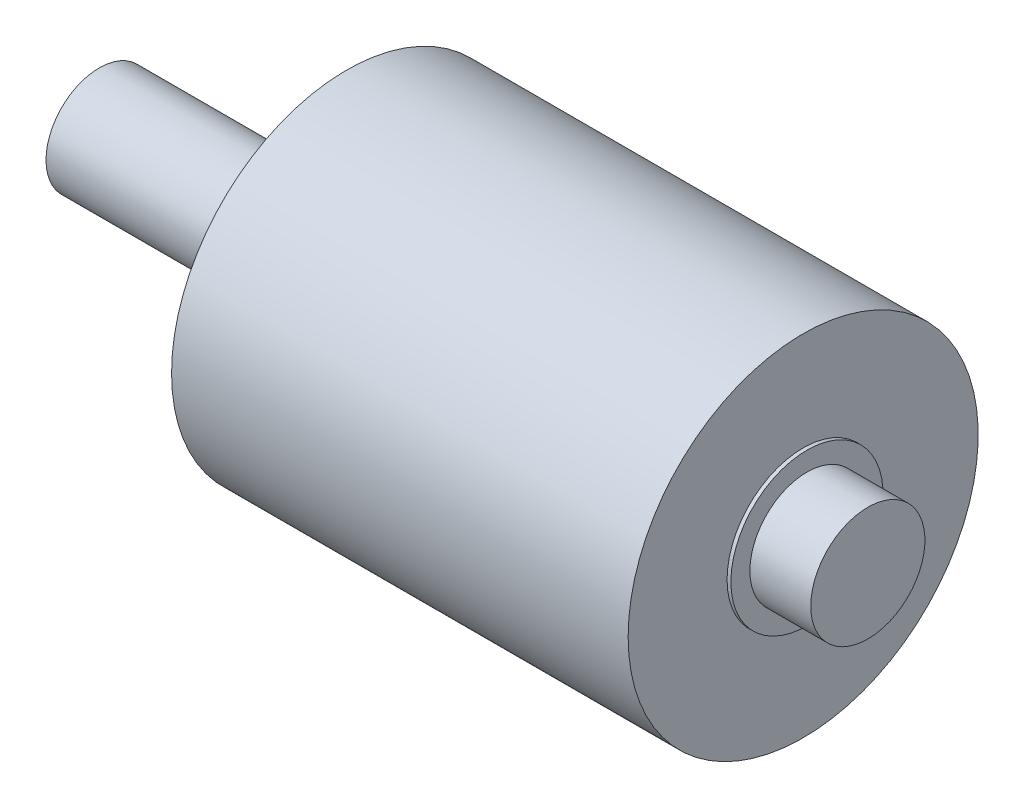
ISO-10303-21;
HEADER;
FILE_DESCRIPTION(('STEP AP214'),'2;1');
FILE_NAME('part.step','',(''),(''),'','','');
FILE_SCHEMA(('AUTOMOTIVE_DESIGN { 1 0 10303 214 1 1 1 1 }'));
ENDSEC;
DATA;
#1=APPLICATION_CONTEXT('core data for automotive mechanical design processes');
#2=APPLICATION_PROTOCOL_DEFINITION('international standard','automotive_design',2000,#1);
#3=PRODUCT_CONTEXT('',#1,'mechanical');
#4=PRODUCT('Part','Part','',(#3));
#5=PRODUCT_RELATED_PRODUCT_CATEGORY('part','',(#4));
#6=PRODUCT_DEFINITION_FORMATION('','',#4);
#7=PRODUCT_DEFINITION_CONTEXT('part definition',#1,'design');
#8=PRODUCT_DEFINITION('design','',#6,#7);
#9=PRODUCT_DEFINITION_SHAPE('','',#8);
#10=(LENGTH_UNIT() NAMED_UNIT(*) SI_UNIT(.MILLI.,.METRE.));
#11=(NAMED_UNIT(*) PLANE_ANGLE_UNIT() SI_UNIT($,.RADIAN.));
#12=(NAMED_UNIT(*) SI_UNIT($,.STERADIAN.) SOLID_ANGLE_UNIT());
#13=UNCERTAINTY_MEASURE_WITH_UNIT(LENGTH_MEASURE(1.E-05),#10,'distance_accuracy_value','');
#14=(GEOMETRIC_REPRESENTATION_CONTEXT(3) GLOBAL_UNCERTAINTY_ASSIGNED_CONTEXT((#13)) GLOBAL_UNIT_ASSIGNED_CONTEXT((#10,
#11,#12)) REPRESENTATION_CONTEXT('',''));
#15=CARTESIAN_POINT('',(0.,0.,0.));
#16=DIRECTION('',(0.,0.,1.));
#17=DIRECTION('',(1.,0.,0.));
#18=AXIS2_PLACEMENT_3D('',#15,#16,#17);
#19=CARTESIAN_POINT('',(-32.5,0.,0.));
#20=DIRECTION('',(-1.,0.,0.));
#21=DIRECTION('',(0.,0.,1.));
#22=AXIS2_PLACEMENT_3D('',#19,#20,#21);
#23=PLANE('',#22);
#24=CARTESIAN_POINT('',(-32.5,0.,0.));
#25=DIRECTION('',(-1.,0.,0.));
#26=DIRECTION('',(0.,0.,1.));
#27=AXIS2_PLACEMENT_3D('',#24,#25,#26);
#28=CIRCLE('',#27,7.);
#29=CARTESIAN_POINT('',(-32.5,0.,7.));
#30=VERTEX_POINT('',#29);
#31=EDGE_CURVE('E18',#30,#30,#28,.F.);
#32=ORIENTED_EDGE('',*,*,#31,.F.);
#33=EDGE_LOOP('',(#32));
#34=FACE_BOUND('',#33,.T.);
#35=ADVANCED_FACE('F15',(#34),#23,.T.);
#36=CARTESIAN_POINT('',(-10.5,0.,0.));
#37=DIRECTION('',(-1.,0.,0.));
#38=DIRECTION('',(0.,0.,1.));
#39=AXIS2_PLACEMENT_3D('',#36,#37,#38);
#40=CYLINDRICAL_SURFACE('',#39,7.);
#41=CARTESIAN_POINT('',(-10.5,0.,0.));
#42=DIRECTION('',(-1.,0.,0.));
#43=DIRECTION('',(0.,0.,1.));
#44=AXIS2_PLACEMENT_3D('',#41,#42,#43);
#45=CIRCLE('',#44,7.);
#46=CARTESIAN_POINT('',(-10.5,0.,7.));
#47=VERTEX_POINT('',#46);
#48=EDGE_CURVE('E52',#47,#47,#45,.F.);
#49=ORIENTED_EDGE('',*,*,#48,.F.);
#50=EDGE_LOOP('',(#49));
#51=FACE_BOUND('',#50,.T.);
#52=ORIENTED_EDGE('',*,*,#31,.T.);
#53=EDGE_LOOP('',(#52));
#54=FACE_BOUND('',#53,.T.);
#55=ADVANCED_FACE('F59',(#51,#54),#40,.T.);
#56=CARTESIAN_POINT('',(68.5,0.,0.));
#57=DIRECTION('',(1.,0.,0.));
#58=DIRECTION('',(0.,0.,-1.));
#59=AXIS2_PLACEMENT_3D('',#56,#57,#58);
#60=PLANE('',#59);
#61=CARTESIAN_POINT('',(68.5,0.,0.));
#62=DIRECTION('',(-1.,0.,0.));
#63=DIRECTION('',(0.,0.,1.));
#64=AXIS2_PLACEMENT_3D('',#61,#62,#63);
#65=CIRCLE('',#64,7.5);
#66=CARTESIAN_POINT('',(68.5,0.,7.5));
#67=VERTEX_POINT('',#66);
#68=EDGE_CURVE('E50',#67,#67,#65,.T.);
#69=ORIENTED_EDGE('',*,*,#68,.F.);
#70=EDGE_LOOP('',(#69));
#71=FACE_BOUND('',#70,.T.);
#72=ADVANCED_FACE('F66',(#71),#60,.T.);
#73=CARTESIAN_POINT('',(-10.5,0.,0.));
#74=DIRECTION('',(-1.,0.,0.));
#75=DIRECTION('',(0.,0.,1.));
#76=AXIS2_PLACEMENT_3D('',#73,#74,#75);
#77=PLANE('',#76);
#78=CARTESIAN_POINT('',(-10.5,0.,0.));
#79=DIRECTION('',(1.,0.,0.));
#80=DIRECTION('',(0.,0.,-1.));
#81=AXIS2_PLACEMENT_3D('',#78,#79,#80);
#82=CIRCLE('',#81,7.5);
#83=CARTESIAN_POINT('',(-10.5,0.,-7.5));
#84=VERTEX_POINT('',#83);
#85=EDGE_CURVE('E47',#84,#84,#82,.T.);
#86=ORIENTED_EDGE('',*,*,#85,.F.);
#87=EDGE_LOOP('',(#86));
#88=FACE_BOUND('',#87,.T.);
#89=ORIENTED_EDGE('',*,*,#48,.T.);
#90=EDGE_LOOP('',(#89));
#91=FACE_BOUND('',#90,.T.);
#92=ADVANCED_FACE('F106',(#88,#91),#77,.T.);
#93=CARTESIAN_POINT('',(68.5,0.,0.));
#94=DIRECTION('',(-1.,0.,0.));
#95=DIRECTION('',(0.,0.,1.));
#96=AXIS2_PLACEMENT_3D('',#93,#94,#95);
#97=CYLINDRICAL_SURFACE('',#96,7.5);
#98=CARTESIAN_POINT('',(60.5,0.,0.));
#99=DIRECTION('',(-1.,0.,0.));
#100=DIRECTION('',(0.,0.,1.));
#101=AXIS2_PLACEMENT_3D('',#98,#99,#100);
#102=CIRCLE('',#101,7.5);
#103=CARTESIAN_POINT('',(60.5,0.,7.5));
#104=VERTEX_POINT('',#103);
#105=EDGE_CURVE('E44',#104,#104,#102,.T.);
#106=ORIENTED_EDGE('',*,*,#105,.F.);
#107=EDGE_LOOP('',(#106));
#108=FACE_BOUND('',#107,.T.);
#109=ORIENTED_EDGE('',*,*,#68,.T.);
#110=EDGE_LOOP('',(#109));
#111=FACE_BOUND('',#110,.T.);
#112=ADVANCED_FACE('F102',(#108,#111),#97,.T.);
#113=CARTESIAN_POINT('',(-32.5,0.,0.));
#114=DIRECTION('',(1.,0.,0.));
#115=DIRECTION('',(0.,0.,-1.));
#116=AXIS2_PLACEMENT_3D('',#113,#114,#115);
#117=CYLINDRICAL_SURFACE('',#116,7.5);
#118=CARTESIAN_POINT('',(-0.5,0.,0.));
#119=DIRECTION('',(1.,0.,0.));
#120=DIRECTION('',(0.,0.,-1.));
#121=AXIS2_PLACEMENT_3D('',#118,#119,#120);
#122=CIRCLE('',#121,7.5);
#123=CARTESIAN_POINT('',(-0.5,0.,-7.5));
#124=VERTEX_POINT('',#123);
#125=EDGE_CURVE('E41',#124,#124,#122,.T.);
#126=ORIENTED_EDGE('',*,*,#125,.F.);
#127=EDGE_LOOP('',(#126));
#128=FACE_BOUND('',#127,.T.);
#129=ORIENTED_EDGE('',*,*,#85,.T.);
#130=EDGE_LOOP('',(#129));
#131=FACE_BOUND('',#130,.T.);
#132=ADVANCED_FACE('F98',(#128,#131),#117,.T.);
#133=CARTESIAN_POINT('',(60.5,0.,0.));
#134=DIRECTION('',(1.,0.,0.));
#135=DIRECTION('',(0.,0.,-1.));
#136=AXIS2_PLACEMENT_3D('',#133,#134,#135);
#137=PLANE('',#136);
#138=ORIENTED_EDGE('',*,*,#105,.T.);
#139=EDGE_LOOP('',(#138));
#140=FACE_BOUND('',#139,.T.);
#141=CARTESIAN_POINT('',(60.5,0.,0.));
#142=DIRECTION('',(-1.,0.,0.));
#143=DIRECTION('',(0.,0.,1.));
#144=AXIS2_PLACEMENT_3D('',#141,#142,#143);
#145=CIRCLE('',#144,10.);
#146=CARTESIAN_POINT('',(60.5,0.,10.));
#147=VERTEX_POINT('',#146);
#148=EDGE_CURVE('E38',#147,#147,#145,.T.);
#149=ORIENTED_EDGE('',*,*,#148,.F.);
#150=EDGE_LOOP('',(#149));
#151=FACE_BOUND('',#150,.T.);
#152=ADVANCED_FACE('F94',(#140,#151),#137,.T.);
#153=CARTESIAN_POINT('',(-0.5,0.,0.));
#154=DIRECTION('',(-1.,0.,0.));
#155=DIRECTION('',(0.,0.,1.));
#156=AXIS2_PLACEMENT_3D('',#153,#154,#155);
#157=PLANE('',#156);
#158=ORIENTED_EDGE('',*,*,#125,.T.);
#159=EDGE_LOOP('',(#158));
#160=FACE_BOUND('',#159,.T.);
#161=CARTESIAN_POINT('',(-0.5,0.,0.));
#162=DIRECTION('',(1.,0.,0.));
#163=DIRECTION('',(0.,0.,-1.));
#164=AXIS2_PLACEMENT_3D('',#161,#162,#163);
#165=CIRCLE('',#164,10.);
#166=CARTESIAN_POINT('',(-0.5,0.,-10.));
#167=VERTEX_POINT('',#166);
#168=EDGE_CURVE('E35',#167,#167,#165,.T.);
#169=ORIENTED_EDGE('',*,*,#168,.F.);
#170=EDGE_LOOP('',(#169));
#171=FACE_BOUND('',#170,.T.);
#172=ADVANCED_FACE('F90',(#160,#171),#157,.T.);
#173=CARTESIAN_POINT('',(60.5,0.,0.));
#174=DIRECTION('',(-1.,0.,0.));
#175=DIRECTION('',(0.,0.,1.));
#176=AXIS2_PLACEMENT_3D('',#173,#174,#175);
#177=CYLINDRICAL_SURFACE('',#176,10.);
#178=CARTESIAN_POINT('',(60.,0.,0.));
#179=DIRECTION('',(-1.,0.,0.));
#180=DIRECTION('',(0.,0.,1.));
#181=AXIS2_PLACEMENT_3D('',#178,#179,#180);
#182=CIRCLE('',#181,10.);
#183=CARTESIAN_POINT('',(60.,0.,10.));
#184=VERTEX_POINT('',#183);
#185=EDGE_CURVE('E32',#184,#184,#182,.T.);
#186=ORIENTED_EDGE('',*,*,#185,.F.);
#187=EDGE_LOOP('',(#186));
#188=FACE_BOUND('',#187,.T.);
#189=ORIENTED_EDGE('',*,*,#148,.T.);
#190=EDGE_LOOP('',(#189));
#191=FACE_BOUND('',#190,.T.);
#192=ADVANCED_FACE('F86',(#188,#191),#177,.T.);
#193=CARTESIAN_POINT('',(-0.5,0.,0.));
#194=DIRECTION('',(1.,0.,0.));
#195=DIRECTION('',(0.,0.,-1.));
#196=AXIS2_PLACEMENT_3D('',#193,#194,#195);
#197=CYLINDRICAL_SURFACE('',#196,10.);
#198=ORIENTED_EDGE('',*,*,#168,.T.);
#199=EDGE_LOOP('',(#198));
#200=FACE_BOUND('',#199,.T.);
#201=CARTESIAN_POINT('',(0.,0.,0.));
#202=DIRECTION('',(1.,0.,0.));
#203=DIRECTION('',(0.,0.,-1.));
#204=AXIS2_PLACEMENT_3D('',#201,#202,#203);
#205=CIRCLE('',#204,10.);
#206=CARTESIAN_POINT('',(0.,0.,-10.));
#207=VERTEX_POINT('',#206);
#208=EDGE_CURVE('E27',#207,#207,#205,.F.);
#209=ORIENTED_EDGE('',*,*,#208,.T.);
#210=EDGE_LOOP('',(#209));
#211=FACE_BOUND('',#210,.T.);
#212=ADVANCED_FACE('F82',(#200,#211),#197,.T.);
#213=CARTESIAN_POINT('',(60.,0.,0.));
#214=DIRECTION('',(1.,0.,0.));
#215=DIRECTION('',(0.,0.,-1.));
#216=AXIS2_PLACEMENT_3D('',#213,#214,#215);
#217=PLANE('',#216);
#218=ORIENTED_EDGE('',*,*,#185,.T.);
#219=EDGE_LOOP('',(#218));
#220=FACE_BOUND('',#219,.T.);
#221=CARTESIAN_POINT('',(60.,0.,0.));
#222=DIRECTION('',(-1.,0.,0.));
#223=DIRECTION('',(0.,0.,1.));
#224=AXIS2_PLACEMENT_3D('',#221,#222,#223);
#225=CIRCLE('',#224,23.);
#226=CARTESIAN_POINT('',(60.,0.,23.));
#227=VERTEX_POINT('',#226);
#228=EDGE_CURVE('E22',#227,#227,#225,.T.);
#229=ORIENTED_EDGE('',*,*,#228,.F.);
#230=EDGE_LOOP('',(#229));
#231=FACE_BOUND('',#230,.T.);
#232=ADVANCED_FACE('F75',(#220,#231),#217,.T.);
#233=CARTESIAN_POINT('',(0.,0.,0.));
#234=DIRECTION('',(1.,0.,0.));
#235=DIRECTION('',(0.,0.,-1.));
#236=AXIS2_PLACEMENT_3D('',#233,#234,#235);
#237=PLANE('',#236);
#238=ORIENTED_EDGE('',*,*,#208,.F.);
#239=EDGE_LOOP('',(#238));
#240=FACE_BOUND('',#239,.T.);
#241=CARTESIAN_POINT('',(0.,0.,0.));
#242=DIRECTION('',(-1.,0.,0.));
#243=DIRECTION('',(0.,0.,1.));
#244=AXIS2_PLACEMENT_3D('',#241,#242,#243);
#245=CIRCLE('',#244,23.);
#246=CARTESIAN_POINT('',(0.,0.,23.));
#247=VERTEX_POINT('',#246);
#248=EDGE_CURVE('E10',#247,#247,#245,.F.);
#249=ORIENTED_EDGE('',*,*,#248,.F.);
#250=EDGE_LOOP('',(#249));
#251=FACE_BOUND('',#250,.T.);
#252=ADVANCED_FACE('F70',(#240,#251),#237,.F.);
#253=CARTESIAN_POINT('',(60.,0.,0.));
#254=DIRECTION('',(-1.,0.,0.));
#255=DIRECTION('',(0.,0.,1.));
#256=AXIS2_PLACEMENT_3D('',#253,#254,#255);
#257=CYLINDRICAL_SURFACE('',#256,23.);
#258=ORIENTED_EDGE('',*,*,#248,.T.);
#259=EDGE_LOOP('',(#258));
#260=FACE_BOUND('',#259,.T.);
#261=ORIENTED_EDGE('',*,*,#228,.T.);
#262=EDGE_LOOP('',(#261));
#263=FACE_BOUND('',#262,.T.);
#264=ADVANCED_FACE('F68',(#260,#263),#257,.T.);
#265=CLOSED_SHELL('',(#35,#55,#72,#92,#112,#132,#152,#172,#192,#212,#232,#252,#264));
#266=MANIFOLD_SOLID_BREP('B1',#265);
#267=ADVANCED_BREP_SHAPE_REPRESENTATION('',(#18,#266),#14);
#268=SHAPE_DEFINITION_REPRESENTATION(#9,#267);
ENDSEC;
END-ISO-10303-21;
